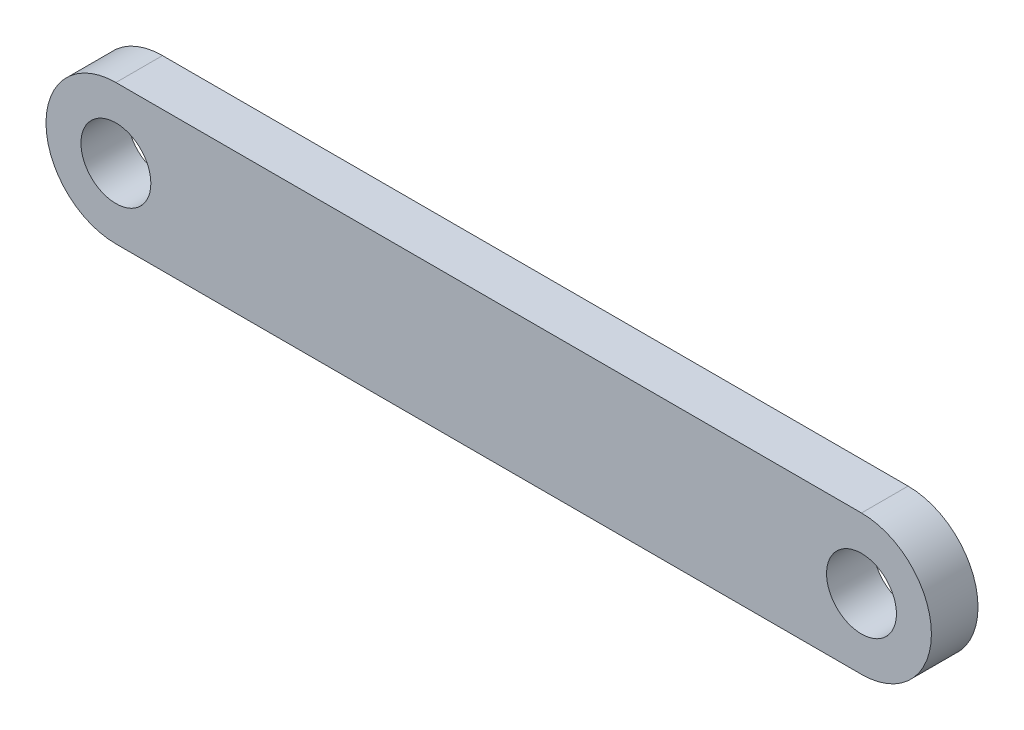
from build123d import *

# Parameters (mm, degrees)
SKETCH1_R          = 9.525
BASE_EXTRUDE_DEPTH = 6.35


with BuildPart() as part:
    # Sketch1 → Base-Extrude (new, symmetric)
    with BuildSketch(Plane.XY):
        with BuildLine():
            Line((0, 19.05), (203.2, 19.05))
            ThreePointArc((203.2, 19.05), (222.25, 0), (203.2, -19.05))
            Line((203.2, -19.05), (0, -19.05))
            ThreePointArc((0, -19.05), (-19.05, 0), (0, 19.05))
        make_face()
        with Locations((203.2, 0)):
            Circle(SKETCH1_R, mode=Mode.SUBTRACT)
        Circle(SKETCH1_R, mode=Mode.SUBTRACT)
    extrude(amount=BASE_EXTRUDE_DEPTH, both=True)


solid = part.part
